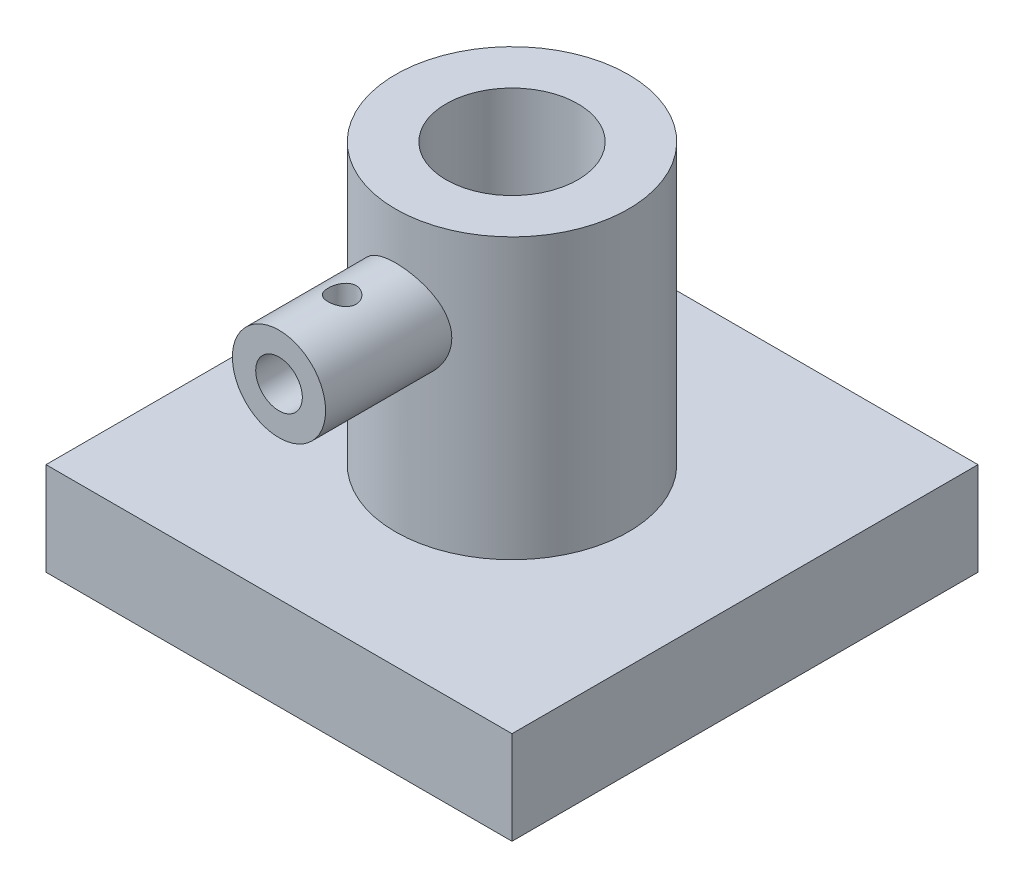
ISO-10303-21;
HEADER;
FILE_DESCRIPTION(('STEP AP214'),'2;1');
FILE_NAME('part.step','',(''),(''),'','','');
FILE_SCHEMA(('AUTOMOTIVE_DESIGN { 1 0 10303 214 1 1 1 1 }'));
ENDSEC;
DATA;
#1=APPLICATION_CONTEXT('core data for automotive mechanical design processes');
#2=APPLICATION_PROTOCOL_DEFINITION('international standard','automotive_design',2000,#1);
#3=PRODUCT_CONTEXT('',#1,'mechanical');
#4=PRODUCT('Part','Part','',(#3));
#5=PRODUCT_RELATED_PRODUCT_CATEGORY('part','',(#4));
#6=PRODUCT_DEFINITION_FORMATION('','',#4);
#7=PRODUCT_DEFINITION_CONTEXT('part definition',#1,'design');
#8=PRODUCT_DEFINITION('design','',#6,#7);
#9=PRODUCT_DEFINITION_SHAPE('','',#8);
#10=(LENGTH_UNIT() NAMED_UNIT(*) SI_UNIT(.MILLI.,.METRE.));
#11=(NAMED_UNIT(*) PLANE_ANGLE_UNIT() SI_UNIT($,.RADIAN.));
#12=(NAMED_UNIT(*) SI_UNIT($,.STERADIAN.) SOLID_ANGLE_UNIT());
#13=UNCERTAINTY_MEASURE_WITH_UNIT(LENGTH_MEASURE(1.E-05),#10,'distance_accuracy_value','');
#14=(GEOMETRIC_REPRESENTATION_CONTEXT(3) GLOBAL_UNCERTAINTY_ASSIGNED_CONTEXT((#13)) GLOBAL_UNIT_ASSIGNED_CONTEXT((#10,
#11,#12)) REPRESENTATION_CONTEXT('',''));
#15=CARTESIAN_POINT('',(0.,0.,0.));
#16=DIRECTION('',(0.,0.,1.));
#17=DIRECTION('',(1.,0.,0.));
#18=AXIS2_PLACEMENT_3D('',#15,#16,#17);
#19=CARTESIAN_POINT('',(-55.1414213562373,0.,0.));
#20=DIRECTION('',(0.,1.,0.));
#21=DIRECTION('',(0.,0.,1.));
#22=AXIS2_PLACEMENT_3D('',#19,#20,#21);
#23=PLANE('',#22);
#24=DIRECTION('',(1.,0.,0.));
#25=VECTOR('',#24,1.);
#26=CARTESIAN_POINT('',(-55.1414213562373,0.,25.));
#27=LINE('',#26,#25);
#28=CARTESIAN_POINT('',(-25.,0.,25.));
#29=VERTEX_POINT('',#28);
#30=CARTESIAN_POINT('',(25.,0.,25.));
#31=VERTEX_POINT('',#30);
#32=EDGE_CURVE('E92',#29,#31,#27,.T.);
#33=ORIENTED_EDGE('',*,*,#32,.T.);
#34=DIRECTION('',(0.,0.,1.));
#35=VECTOR('',#34,1.);
#36=CARTESIAN_POINT('',(25.,0.,0.));
#37=LINE('',#36,#35);
#38=CARTESIAN_POINT('',(25.,0.,-25.));
#39=VERTEX_POINT('',#38);
#40=EDGE_CURVE('E101',#39,#31,#37,.T.);
#41=ORIENTED_EDGE('',*,*,#40,.F.);
#42=DIRECTION('',(1.,0.,0.));
#43=VECTOR('',#42,1.);
#44=CARTESIAN_POINT('',(-55.1414213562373,0.,-25.));
#45=LINE('',#44,#43);
#46=CARTESIAN_POINT('',(-25.,0.,-25.));
#47=VERTEX_POINT('',#46);
#48=EDGE_CURVE('E106',#47,#39,#45,.T.);
#49=ORIENTED_EDGE('',*,*,#48,.F.);
#50=DIRECTION('',(0.,0.,1.));
#51=VECTOR('',#50,1.);
#52=CARTESIAN_POINT('',(-25.,0.,0.));
#53=LINE('',#52,#51);
#54=EDGE_CURVE('E109',#47,#29,#53,.T.);
#55=ORIENTED_EDGE('',*,*,#54,.T.);
#56=EDGE_LOOP('',(#33,#41,#49,#55));
#57=FACE_BOUND('',#56,.T.);
#58=CARTESIAN_POINT('',(0.,0.,0.));
#59=DIRECTION('',(0.,1.,0.));
#60=DIRECTION('',(0.,0.,1.));
#61=AXIS2_PLACEMENT_3D('',#58,#59,#60);
#62=CIRCLE('',#61,12.5);
#63=CARTESIAN_POINT('',(0.,0.,12.5));
#64=VERTEX_POINT('',#63);
#65=EDGE_CURVE('E113',#64,#64,#62,.T.);
#66=ORIENTED_EDGE('',*,*,#65,.F.);
#67=EDGE_LOOP('',(#66));
#68=FACE_BOUND('',#67,.T.);
#69=ADVANCED_FACE('F45',(#57,#68),#23,.T.);
#70=CARTESIAN_POINT('',(-55.1414213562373,-10.,25.));
#71=DIRECTION('',(0.,0.,1.));
#72=DIRECTION('',(1.,0.,0.));
#73=AXIS2_PLACEMENT_3D('',#70,#71,#72);
#74=PLANE('',#73);
#75=ORIENTED_EDGE('',*,*,#32,.F.);
#76=DIRECTION('',(0.,1.,0.));
#77=VECTOR('',#76,1.);
#78=CARTESIAN_POINT('',(-25.,-10.,25.));
#79=LINE('',#78,#77);
#80=CARTESIAN_POINT('',(-25.,-10.,25.));
#81=VERTEX_POINT('',#80);
#82=EDGE_CURVE('E13',#81,#29,#79,.T.);
#83=ORIENTED_EDGE('',*,*,#82,.F.);
#84=DIRECTION('',(1.,0.,0.));
#85=VECTOR('',#84,1.);
#86=CARTESIAN_POINT('',(-55.1414213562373,-10.,25.));
#87=LINE('',#86,#85);
#88=CARTESIAN_POINT('',(25.,-10.,25.));
#89=VERTEX_POINT('',#88);
#90=EDGE_CURVE('E94',#81,#89,#87,.T.);
#91=ORIENTED_EDGE('',*,*,#90,.T.);
#92=DIRECTION('',(0.,1.,0.));
#93=VECTOR('',#92,1.);
#94=CARTESIAN_POINT('',(25.,-10.,25.));
#95=LINE('',#94,#93);
#96=EDGE_CURVE('E89',#89,#31,#95,.T.);
#97=ORIENTED_EDGE('',*,*,#96,.T.);
#98=EDGE_LOOP('',(#75,#83,#91,#97));
#99=FACE_BOUND('',#98,.T.);
#100=ADVANCED_FACE('F47',(#99),#74,.T.);
#101=CARTESIAN_POINT('',(-25.,-10.,0.));
#102=DIRECTION('',(-1.,0.,0.));
#103=DIRECTION('',(0.,0.,1.));
#104=AXIS2_PLACEMENT_3D('',#101,#102,#103);
#105=PLANE('',#104);
#106=ORIENTED_EDGE('',*,*,#54,.F.);
#107=DIRECTION('',(0.,1.,0.));
#108=VECTOR('',#107,1.);
#109=CARTESIAN_POINT('',(-25.,-10.,-25.));
#110=LINE('',#109,#108);
#111=CARTESIAN_POINT('',(-25.,-10.,-25.));
#112=VERTEX_POINT('',#111);
#113=EDGE_CURVE('E58',#112,#47,#110,.T.);
#114=ORIENTED_EDGE('',*,*,#113,.F.);
#115=DIRECTION('',(0.,0.,1.));
#116=VECTOR('',#115,1.);
#117=CARTESIAN_POINT('',(-25.,-10.,0.));
#118=LINE('',#117,#116);
#119=EDGE_CURVE('E98',#112,#81,#118,.T.);
#120=ORIENTED_EDGE('',*,*,#119,.T.);
#121=ORIENTED_EDGE('',*,*,#82,.T.);
#122=EDGE_LOOP('',(#106,#114,#120,#121));
#123=FACE_BOUND('',#122,.T.);
#124=ADVANCED_FACE('F129',(#123),#105,.T.);
#125=CARTESIAN_POINT('',(-55.1414213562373,-10.,-25.));
#126=DIRECTION('',(0.,0.,1.));
#127=DIRECTION('',(1.,0.,0.));
#128=AXIS2_PLACEMENT_3D('',#125,#126,#127);
#129=PLANE('',#128);
#130=ORIENTED_EDGE('',*,*,#48,.T.);
#131=DIRECTION('',(0.,1.,0.));
#132=VECTOR('',#131,1.);
#133=CARTESIAN_POINT('',(25.,-10.,-25.));
#134=LINE('',#133,#132);
#135=CARTESIAN_POINT('',(25.,-10.,-25.));
#136=VERTEX_POINT('',#135);
#137=EDGE_CURVE('E97',#136,#39,#134,.T.);
#138=ORIENTED_EDGE('',*,*,#137,.F.);
#139=DIRECTION('',(1.,0.,0.));
#140=VECTOR('',#139,1.);
#141=CARTESIAN_POINT('',(-55.1414213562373,-10.,-25.));
#142=LINE('',#141,#140);
#143=EDGE_CURVE('E122',#112,#136,#142,.T.);
#144=ORIENTED_EDGE('',*,*,#143,.F.);
#145=ORIENTED_EDGE('',*,*,#113,.T.);
#146=EDGE_LOOP('',(#130,#138,#144,#145));
#147=FACE_BOUND('',#146,.T.);
#148=ADVANCED_FACE('F127',(#147),#129,.F.);
#149=CARTESIAN_POINT('',(25.,-10.,0.));
#150=DIRECTION('',(-1.,0.,0.));
#151=DIRECTION('',(0.,0.,1.));
#152=AXIS2_PLACEMENT_3D('',#149,#150,#151);
#153=PLANE('',#152);
#154=ORIENTED_EDGE('',*,*,#40,.T.);
#155=ORIENTED_EDGE('',*,*,#96,.F.);
#156=DIRECTION('',(0.,0.,1.));
#157=VECTOR('',#156,1.);
#158=CARTESIAN_POINT('',(25.,-10.,0.));
#159=LINE('',#158,#157);
#160=EDGE_CURVE('E120',#136,#89,#159,.T.);
#161=ORIENTED_EDGE('',*,*,#160,.F.);
#162=ORIENTED_EDGE('',*,*,#137,.T.);
#163=EDGE_LOOP('',(#154,#155,#161,#162));
#164=FACE_BOUND('',#163,.T.);
#165=ADVANCED_FACE('F102',(#164),#153,.F.);
#166=CARTESIAN_POINT('',(-55.1414213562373,-10.,0.));
#167=DIRECTION('',(0.,1.,0.));
#168=DIRECTION('',(0.,0.,1.));
#169=AXIS2_PLACEMENT_3D('',#166,#167,#168);
#170=PLANE('',#169);
#171=CARTESIAN_POINT('',(0.,-10.,0.));
#172=DIRECTION('',(0.,1.,0.));
#173=DIRECTION('',(0.,0.,1.));
#174=AXIS2_PLACEMENT_3D('',#171,#172,#173);
#175=CIRCLE('',#174,7.07106781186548);
#176=CARTESIAN_POINT('',(0.,-10.,7.07106781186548));
#177=VERTEX_POINT('',#176);
#178=EDGE_CURVE('E197',#177,#177,#175,.T.);
#179=ORIENTED_EDGE('',*,*,#178,.T.);
#180=EDGE_LOOP('',(#179));
#181=FACE_BOUND('',#180,.T.);
#182=ORIENTED_EDGE('',*,*,#90,.F.);
#183=ORIENTED_EDGE('',*,*,#119,.F.);
#184=ORIENTED_EDGE('',*,*,#143,.T.);
#185=ORIENTED_EDGE('',*,*,#160,.T.);
#186=EDGE_LOOP('',(#182,#183,#184,#185));
#187=FACE_BOUND('',#186,.T.);
#188=ADVANCED_FACE('F131',(#181,#187),#170,.F.);
#189=CARTESIAN_POINT('',(0.,30.,0.));
#190=DIRECTION('',(0.,-1.,0.));
#191=DIRECTION('',(0.,0.,-1.));
#192=AXIS2_PLACEMENT_3D('',#189,#190,#191);
#193=CYLINDRICAL_SURFACE('',#192,12.5);
#194=CARTESIAN_POINT('',(0.,25.,12.5));
#195=CARTESIAN_POINT('',(0.134428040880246,24.9999992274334,12.4999993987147));
#196=CARTESIAN_POINT('',(0.268907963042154,24.9945712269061,12.4978254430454));
#197=CARTESIAN_POINT('',(0.536916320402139,24.972908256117,12.4891841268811));
#198=CARTESIAN_POINT('',(0.670444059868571,24.9566660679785,12.482713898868));
#199=CARTESIAN_POINT('',(0.935792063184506,24.9134912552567,12.4656328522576));
#200=CARTESIAN_POINT('',(1.06760803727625,24.8865357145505,12.45501315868));
#201=CARTESIAN_POINT('',(1.32834211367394,24.822193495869,12.4299104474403));
#202=CARTESIAN_POINT('',(1.45725900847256,24.7848025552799,12.4154258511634));
#203=CARTESIAN_POINT('',(1.71081101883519,24.7000976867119,12.3830283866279));
#204=CARTESIAN_POINT('',(1.83546024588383,24.6528210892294,12.3651284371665));
#205=CARTESIAN_POINT('',(2.08021423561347,24.5486729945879,12.3263173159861));
#206=CARTESIAN_POINT('',(2.20031728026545,24.4917979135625,12.3054050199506));
#207=CARTESIAN_POINT('',(2.5525365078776,24.3075069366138,12.2389309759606));
#208=CARTESIAN_POINT('',(2.77691477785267,24.1663067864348,12.1895849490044));
#209=CARTESIAN_POINT('',(3.20878788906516,23.8444050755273,12.0832695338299));
#210=CARTESIAN_POINT('',(3.41514420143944,23.6622677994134,12.0260638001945));
#211=CARTESIAN_POINT('',(3.795448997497,23.2664655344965,11.9115080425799));
#212=CARTESIAN_POINT('',(3.96938162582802,23.0527852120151,11.8541579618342));
#213=CARTESIAN_POINT('',(4.20603567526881,22.7073939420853,11.7714356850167));
#214=CARTESIAN_POINT('',(4.28222203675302,22.585220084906,11.7438622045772));
#215=CARTESIAN_POINT('',(4.42396507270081,22.3343638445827,11.6912035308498));
#216=CARTESIAN_POINT('',(4.4895261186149,22.2056841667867,11.6661173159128));
#217=CARTESIAN_POINT('',(4.60945924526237,21.9426245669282,11.6192528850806));
#218=CARTESIAN_POINT('',(4.66383056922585,21.8082442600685,11.5974748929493));
#219=CARTESIAN_POINT('',(4.76082403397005,21.5347911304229,11.5579971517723));
#220=CARTESIAN_POINT('',(4.8034520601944,21.39572069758,11.5402953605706));
#221=CARTESIAN_POINT('',(4.87487504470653,21.1202338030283,11.5103008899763));
#222=CARTESIAN_POINT('',(4.90420529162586,20.9839786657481,11.4978009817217));
#223=CARTESIAN_POINT('',(4.95140857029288,20.7092063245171,11.4775526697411));
#224=CARTESIAN_POINT('',(4.9692867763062,20.5706901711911,11.4698021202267));
#225=CARTESIAN_POINT('',(4.99338985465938,20.2924867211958,11.4593294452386));
#226=CARTESIAN_POINT('',(4.99961718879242,20.152799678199,11.4566062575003));
#227=CARTESIAN_POINT('',(5.00034850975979,19.8733924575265,11.4562871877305));
#228=CARTESIAN_POINT('',(4.99485304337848,19.7336722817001,11.4586910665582));
#229=CARTESIAN_POINT('',(4.97300139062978,19.4650957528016,11.4681900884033));
#230=CARTESIAN_POINT('',(4.95743098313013,19.3361625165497,11.4749456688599));
#231=CARTESIAN_POINT('',(4.91636669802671,19.0801331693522,11.4925992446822));
#232=CARTESIAN_POINT('',(4.89086955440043,18.9530376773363,11.5034986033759));
#233=CARTESIAN_POINT('',(4.83020381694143,18.7015982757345,11.5291029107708));
#234=CARTESIAN_POINT('',(4.79503755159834,18.5772537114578,11.5438069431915));
#235=CARTESIAN_POINT('',(4.71535272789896,18.332038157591,11.5765839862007));
#236=CARTESIAN_POINT('',(4.67083057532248,18.2111685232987,11.5946582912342));
#237=CARTESIAN_POINT('',(4.52178156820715,17.850100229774,11.6539749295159));
#238=CARTESIAN_POINT('',(4.40296429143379,17.6163670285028,11.6997808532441));
#239=CARTESIAN_POINT('',(4.13125151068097,17.1714203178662,11.7984565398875));
#240=CARTESIAN_POINT('',(3.97834320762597,16.9602153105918,11.851328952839));
#241=CARTESIAN_POINT('',(3.62889137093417,16.5489925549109,11.9631659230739));
#242=CARTESIAN_POINT('',(3.42988845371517,16.3511017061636,12.0222854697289));
#243=CARTESIAN_POINT('',(3.0007412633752,15.9907652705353,12.1365017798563));
#244=CARTESIAN_POINT('',(2.77059080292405,15.8283267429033,12.1915977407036));
#245=CARTESIAN_POINT('',(2.40397180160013,15.6134750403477,12.2673153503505));
#246=CARTESIAN_POINT('',(2.2767950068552,15.5461273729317,12.2916102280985));
#247=CARTESIAN_POINT('',(2.01664956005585,15.4224644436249,12.3369572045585));
#248=CARTESIAN_POINT('',(1.88368330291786,15.3661446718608,12.3580106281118));
#249=CARTESIAN_POINT('',(1.61291597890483,15.2650884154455,12.3962575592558));
#250=CARTESIAN_POINT('',(1.47511586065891,15.2203496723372,12.4134518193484));
#251=CARTESIAN_POINT('',(1.19570710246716,15.1429130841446,12.4434728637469));
#252=CARTESIAN_POINT('',(1.05409872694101,15.1102144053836,12.4562999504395));
#253=CARTESIAN_POINT('',(0.776729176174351,15.0588068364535,12.4765727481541));
#254=CARTESIAN_POINT('',(0.641120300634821,15.0393823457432,12.4842928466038));
#255=CARTESIAN_POINT('',(0.368536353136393,15.0117185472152,12.4953107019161));
#256=CARTESIAN_POINT('',(0.231560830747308,15.0034830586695,12.4986069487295));
#257=CARTESIAN_POINT('',(-0.0425534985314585,14.9983032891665,12.5006785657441));
#258=CARTESIAN_POINT('',(-0.179692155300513,15.0013521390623,12.4994566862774));
#259=CARTESIAN_POINT('',(-0.453193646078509,15.0186951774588,12.4925311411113));
#260=CARTESIAN_POINT('',(-0.589556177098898,15.032993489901,12.4868258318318));
#261=CARTESIAN_POINT('',(-0.854248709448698,15.0717821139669,12.4714486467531));
#262=CARTESIAN_POINT('',(-0.982662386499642,15.095780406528,12.4619685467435));
#263=CARTESIAN_POINT('',(-1.236951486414,15.1536650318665,12.4393027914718));
#264=CARTESIAN_POINT('',(-1.36282600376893,15.1875548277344,12.4261158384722));
#265=CARTESIAN_POINT('',(-1.61115102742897,15.2649082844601,12.396363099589));
#266=CARTESIAN_POINT('',(-1.73360251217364,15.3083691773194,12.3797982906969));
#267=CARTESIAN_POINT('',(-1.97439656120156,15.4045030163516,12.3436873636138));
#268=CARTESIAN_POINT('',(-2.0927375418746,15.4571794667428,12.324140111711));
#269=CARTESIAN_POINT('',(-2.44755555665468,15.6319072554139,12.2604306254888));
#270=CARTESIAN_POINT('',(-2.67640599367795,15.7683460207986,12.2121249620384));
#271=CARTESIAN_POINT('',(-3.10864805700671,16.0748684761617,12.1093295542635));
#272=CARTESIAN_POINT('',(-3.31202942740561,16.2449656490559,12.0548373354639));
#273=CARTESIAN_POINT('',(-3.70179180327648,16.6271584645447,11.941130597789));
#274=CARTESIAN_POINT('',(-3.88616393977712,16.8412854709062,11.8818418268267));
#275=CARTESIAN_POINT('',(-4.21689889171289,17.2986485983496,11.7685360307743));
#276=CARTESIAN_POINT('',(-4.3632554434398,17.5418895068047,11.7145198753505));
#277=CARTESIAN_POINT('',(-4.55142555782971,17.9251186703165,11.6421255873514));
#278=CARTESIAN_POINT('',(-4.60914530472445,18.0566797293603,11.6193337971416));
#279=CARTESIAN_POINT('',(-4.71320516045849,18.3247871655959,11.5775147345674));
#280=CARTESIAN_POINT('',(-4.75955021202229,18.4613313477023,11.5584858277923));
#281=CARTESIAN_POINT('',(-4.84036067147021,18.7383631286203,11.5248785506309));
#282=CARTESIAN_POINT('',(-4.87483074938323,18.8788491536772,11.5102984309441));
#283=CARTESIAN_POINT('',(-4.93151664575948,19.1626946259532,11.4861263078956));
#284=CARTESIAN_POINT('',(-4.95373349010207,19.3060538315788,11.4765338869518));
#285=CARTESIAN_POINT('',(-4.98448195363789,19.5839989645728,11.463210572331));
#286=CARTESIAN_POINT('',(-4.9938856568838,19.7184712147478,11.4591065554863));
#287=CARTESIAN_POINT('',(-5.00180093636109,19.9878460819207,11.4556539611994));
#288=CARTESIAN_POINT('',(-5.00030885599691,20.1227488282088,11.4563069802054));
#289=CARTESIAN_POINT('',(-4.9864434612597,20.3918171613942,11.4623486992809));
#290=CARTESIAN_POINT('',(-4.97407559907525,20.5259830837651,11.4677350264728));
#291=CARTESIAN_POINT('',(-4.93860056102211,20.7926720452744,11.4830569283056));
#292=CARTESIAN_POINT('',(-4.91548933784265,20.9251944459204,11.4929942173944));
#293=CARTESIAN_POINT('',(-4.85990688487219,21.182329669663,11.5166044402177));
#294=CARTESIAN_POINT('',(-4.82784722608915,21.3070467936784,11.5301119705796));
#295=CARTESIAN_POINT('',(-4.7543555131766,21.553266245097,11.5606089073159));
#296=CARTESIAN_POINT('',(-4.71292020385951,21.6747674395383,11.5775995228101));
#297=CARTESIAN_POINT('',(-4.57505004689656,22.0333144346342,11.6330901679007));
#298=CARTESIAN_POINT('',(-4.46501084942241,22.2645872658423,11.6761269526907));
#299=CARTESIAN_POINT('',(-4.20467910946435,22.7190564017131,11.7724663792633));
#300=CARTESIAN_POINT('',(-4.05244254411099,22.9410320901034,11.8262157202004));
#301=CARTESIAN_POINT('',(-3.71470108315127,23.3574978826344,11.9366014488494));
#302=CARTESIAN_POINT('',(-3.52918616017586,23.5519796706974,11.9932387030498));
#303=CARTESIAN_POINT('',(-3.22271513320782,23.8255134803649,12.0779292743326));
#304=CARTESIAN_POINT('',(-3.11206947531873,23.9160564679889,12.1069791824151));
#305=CARTESIAN_POINT('',(-2.88318647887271,24.0874993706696,12.1635153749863));
#306=CARTESIAN_POINT('',(-2.76495189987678,24.1684027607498,12.1910022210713));
#307=CARTESIAN_POINT('',(-2.52148785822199,24.3200337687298,12.2436771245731));
#308=CARTESIAN_POINT('',(-2.3962519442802,24.3907517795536,12.268863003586));
#309=CARTESIAN_POINT('',(-2.13974317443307,24.5213045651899,12.3161883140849));
#310=CARTESIAN_POINT('',(-2.00847311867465,24.5811443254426,12.338329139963));
#311=CARTESIAN_POINT('',(-1.7431850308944,24.6884332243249,12.378569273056));
#312=CARTESIAN_POINT('',(-1.60925996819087,24.736087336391,12.3967345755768));
#313=CARTESIAN_POINT('',(-1.33744351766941,24.819902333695,12.4289968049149));
#314=CARTESIAN_POINT('',(-1.19955402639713,24.8560686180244,12.4430956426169));
#315=CARTESIAN_POINT('',(-0.921178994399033,24.9164690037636,12.4667917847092));
#316=CARTESIAN_POINT('',(-0.780700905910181,24.9407330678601,12.4764003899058));
#317=CARTESIAN_POINT('',(-0.498015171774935,24.977174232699,12.4908758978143));
#318=CARTESIAN_POINT('',(-0.355808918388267,24.9893604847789,12.4957463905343));
#319=CARTESIAN_POINT('',(-0.177825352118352,24.9969636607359,12.4987857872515));
#320=CARTESIAN_POINT('',(-0.142272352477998,24.9981020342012,12.4992409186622));
#321=CARTESIAN_POINT('',(-0.071147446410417,24.9996203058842,12.4998481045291));
#322=CARTESIAN_POINT('',(-0.0355755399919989,25.0000002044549,12.5000001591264));
#323=CARTESIAN_POINT('',(0.,25.,12.5));
#324=B_SPLINE_CURVE_WITH_KNOTS('',3,(#194,#195,#196,#197,#198,#199,#200,#201,#202,#203,#204,
#205,#206,#207,#208,#209,#210,#211,#212,#213,#214,#215,#216,#217,#218,#219,#220,#221,#222,#223,
#224,#225,#226,#227,#228,#229,#230,#231,#232,#233,#234,#235,#236,#237,#238,#239,#240,#241,#242,
#243,#244,#245,#246,#247,#248,#249,#250,#251,#252,#253,#254,#255,#256,#257,#258,#259,#260,#261,
#262,#263,#264,#265,#266,#267,#268,#269,#270,#271,#272,#273,#274,#275,#276,#277,#278,#279,#280,
#281,#282,#283,#284,#285,#286,#287,#288,#289,#290,#291,#292,#293,#294,#295,#296,#297,#298,#299,
#300,#301,#302,#303,#304,#305,#306,#307,#308,#309,#310,#311,#312,#313,#314,#315,#316,#317,#318,
#319,#320,#321,#322,#323),.UNSPECIFIED.,.T.,.F.,(4,2,2,2,2,2,2,2,2,2,2,2,2,2,2,2,2,2,2,2,2,2,2,
2,2,2,2,2,2,2,2,2,2,2,2,2,2,2,2,2,2,2,2,2,2,2,2,2,2,2,2,2,2,2,2,2,2,2,2,2,2,2,2,2,4),(0.,
0.403247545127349,0.806764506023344,1.21114928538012,1.61569948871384,2.01874874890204,
2.42194883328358,3.22723902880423,4.06710473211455,4.90738006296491,5.34671991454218,
5.78587855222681,6.22506688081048,6.66403469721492,7.08328748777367,7.50235071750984,
7.92132539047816,8.34028052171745,8.7299592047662,9.11976620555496,9.50947941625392,
9.89934261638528,10.6941760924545,11.4893084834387,12.345906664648,13.2026752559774,
13.6400384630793,14.0772224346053,14.5143210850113,14.9513894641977,15.3624968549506,
15.7737445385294,16.1847419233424,16.5958900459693,16.9883780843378,17.3810037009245,
17.7735159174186,18.1661777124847,18.9747143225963,19.783575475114,20.6458383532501,
21.5082432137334,21.944151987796,22.379871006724,22.815418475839,23.2509294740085,
23.6550039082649,24.0592139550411,24.4632214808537,24.8673813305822,25.2553678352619,
25.6434892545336,26.4191721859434,27.2392679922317,28.0596113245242,28.4968494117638,
28.9339293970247,29.3714189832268,29.8087075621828,30.2380680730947,30.667226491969,
31.0952989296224,31.5230467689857,31.6297637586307,31.7364806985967),.UNSPECIFIED.);
#325=CARTESIAN_POINT('',(0.,25.,12.5));
#326=VERTEX_POINT('',#325);
#327=EDGE_CURVE('E49',#326,#326,#324,.T.);
#328=ORIENTED_EDGE('',*,*,#327,.T.);
#329=EDGE_LOOP('',(#328));
#330=FACE_BOUND('',#329,.T.);
#331=CARTESIAN_POINT('',(0.,30.,0.));
#332=DIRECTION('',(0.,1.,0.));
#333=DIRECTION('',(0.,0.,1.));
#334=AXIS2_PLACEMENT_3D('',#331,#332,#333);
#335=CIRCLE('',#334,12.5);
#336=CARTESIAN_POINT('',(0.,30.,12.5));
#337=VERTEX_POINT('',#336);
#338=EDGE_CURVE('E110',#337,#337,#335,.T.);
#339=ORIENTED_EDGE('',*,*,#338,.F.);
#340=EDGE_LOOP('',(#339));
#341=FACE_BOUND('',#340,.T.);
#342=ORIENTED_EDGE('',*,*,#65,.T.);
#343=EDGE_LOOP('',(#342));
#344=FACE_BOUND('',#343,.T.);
#345=ADVANCED_FACE('F133',(#330,#341,#344),#193,.T.);
#346=CARTESIAN_POINT('',(0.,30.,0.));
#347=DIRECTION('',(0.,1.,0.));
#348=DIRECTION('',(0.,0.,1.));
#349=AXIS2_PLACEMENT_3D('',#346,#347,#348);
#350=PLANE('',#349);
#351=CARTESIAN_POINT('',(0.,30.,0.));
#352=DIRECTION('',(0.,1.,0.));
#353=DIRECTION('',(0.,0.,1.));
#354=AXIS2_PLACEMENT_3D('',#351,#352,#353);
#355=CIRCLE('',#354,7.07106781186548);
#356=CARTESIAN_POINT('',(0.,30.,7.07106781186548));
#357=VERTEX_POINT('',#356);
#358=EDGE_CURVE('E169',#357,#357,#355,.T.);
#359=ORIENTED_EDGE('',*,*,#358,.F.);
#360=EDGE_LOOP('',(#359));
#361=FACE_BOUND('',#360,.T.);
#362=ORIENTED_EDGE('',*,*,#338,.T.);
#363=EDGE_LOOP('',(#362));
#364=FACE_BOUND('',#363,.T.);
#365=ADVANCED_FACE('F140',(#361,#364),#350,.T.);
#366=CARTESIAN_POINT('',(0.,20.,0.));
#367=DIRECTION('',(0.,0.,-1.));
#368=DIRECTION('',(0.,1.,0.));
#369=AXIS2_PLACEMENT_3D('',#366,#367,#368);
#370=CYLINDRICAL_SURFACE('',#369,5.);
#371=CARTESIAN_POINT('',(0.,25.,19.7282196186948));
#372=CARTESIAN_POINT('',(0.0822886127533,24.9999992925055,19.7282186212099));
#373=CARTESIAN_POINT('',(0.16458731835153,24.9979491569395,19.7214257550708));
#374=CARTESIAN_POINT('',(0.326788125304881,24.9899710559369,19.6944982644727));
#375=CARTESIAN_POINT('',(0.40668950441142,24.9840419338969,19.6743596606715));
#376=CARTESIAN_POINT('',(0.561732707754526,24.9689555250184,19.6214736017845));
#377=CARTESIAN_POINT('',(0.636881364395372,24.9598030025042,19.5887447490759));
#378=CARTESIAN_POINT('',(0.78062418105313,24.9392210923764,19.511683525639));
#379=CARTESIAN_POINT('',(0.849217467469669,24.9277914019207,19.4673496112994));
#380=CARTESIAN_POINT('',(0.979871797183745,24.9035073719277,19.3669956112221));
#381=CARTESIAN_POINT('',(1.04171807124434,24.8906238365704,19.3107029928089));
#382=CARTESIAN_POINT('',(1.15524920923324,24.8650583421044,19.1886103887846));
#383=CARTESIAN_POINT('',(1.20693236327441,24.852376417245,19.1228088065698));
#384=CARTESIAN_POINT('',(1.29980037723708,24.8283411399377,18.9817488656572));
#385=CARTESIAN_POINT('',(1.34072309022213,24.8170240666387,18.9063111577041));
#386=CARTESIAN_POINT('',(1.4092139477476,24.7974362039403,18.7492303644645));
#387=CARTESIAN_POINT('',(1.43678529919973,24.7891646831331,18.6675887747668));
#388=CARTESIAN_POINT('',(1.47701633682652,24.7769087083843,18.5028293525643));
#389=CARTESIAN_POINT('',(1.49007196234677,24.7728106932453,18.4198168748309));
#390=CARTESIAN_POINT('',(1.50213730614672,24.7690278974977,18.252686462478));
#391=CARTESIAN_POINT('',(1.50115042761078,24.7693420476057,18.1685688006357));
#392=CARTESIAN_POINT('',(1.48546977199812,24.7742474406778,18.0048357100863));
#393=CARTESIAN_POINT('',(1.47127205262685,24.7786838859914,17.9251673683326));
#394=CARTESIAN_POINT('',(1.43037420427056,24.7910835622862,17.7693998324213));
#395=CARTESIAN_POINT('',(1.40367284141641,24.7990471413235,17.6933009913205));
#396=CARTESIAN_POINT('',(1.33816026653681,24.8177273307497,17.5456192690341));
#397=CARTESIAN_POINT('',(1.29918816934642,24.8284801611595,17.4741125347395));
#398=CARTESIAN_POINT('',(1.21035222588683,24.8515098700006,17.3384875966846));
#399=CARTESIAN_POINT('',(1.16048574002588,24.8637871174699,17.274371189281));
#400=CARTESIAN_POINT('',(1.04881290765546,24.8891101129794,17.1525334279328));
#401=CARTESIAN_POINT('',(0.986594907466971,24.902166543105,17.0951909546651));
#402=CARTESIAN_POINT('',(0.853263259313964,24.9271224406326,16.9916656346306));
#403=CARTESIAN_POINT('',(0.782149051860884,24.9390218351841,16.9454834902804));
#404=CARTESIAN_POINT('',(0.6323550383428,24.9604316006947,16.8653596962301));
#405=CARTESIAN_POINT('',(0.553627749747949,24.9699254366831,16.8315021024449));
#406=CARTESIAN_POINT('',(0.391245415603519,24.9853352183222,16.7776200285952));
#407=CARTESIAN_POINT('',(0.30759175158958,24.99125216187,16.7575916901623));
#408=CARTESIAN_POINT('',(0.14095224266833,24.9986836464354,16.7325674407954));
#409=CARTESIAN_POINT('',(0.0580500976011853,25.0003485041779,16.7270580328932));
#410=CARTESIAN_POINT('',(-0.107499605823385,24.9995292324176,16.7297887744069));
#411=CARTESIAN_POINT('',(-0.190147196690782,24.9970456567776,16.7380270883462));
#412=CARTESIAN_POINT('',(-0.350903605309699,24.9883069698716,16.7676042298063));
#413=CARTESIAN_POINT('',(-0.429072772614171,24.9821382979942,16.7886430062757));
#414=CARTESIAN_POINT('',(-0.580754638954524,24.9667434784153,16.842862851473));
#415=CARTESIAN_POINT('',(-0.654266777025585,24.9575169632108,16.8760453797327));
#416=CARTESIAN_POINT('',(-0.796437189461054,24.9366965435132,16.9544727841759));
#417=CARTESIAN_POINT('',(-0.864943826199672,24.9250528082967,16.9999789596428));
#418=CARTESIAN_POINT('',(-0.993523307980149,24.9007346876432,17.1014443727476));
#419=CARTESIAN_POINT('',(-1.05359403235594,24.8880600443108,17.1574062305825));
#420=CARTESIAN_POINT('',(-1.16585744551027,24.8625317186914,17.2806069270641));
#421=CARTESIAN_POINT('',(-1.21768481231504,24.8496882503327,17.3481814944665));
#422=CARTESIAN_POINT('',(-1.30928995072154,24.8257651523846,17.4913475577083));
#423=CARTESIAN_POINT('',(-1.34906803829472,24.8146854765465,17.566938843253));
#424=CARTESIAN_POINT('',(-1.41517347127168,24.7956718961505,17.7237521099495));
#425=CARTESIAN_POINT('',(-1.4415634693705,24.7877233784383,17.8049458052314));
#426=CARTESIAN_POINT('',(-1.48021730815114,24.7759159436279,17.9709075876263));
#427=CARTESIAN_POINT('',(-1.49248598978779,24.772055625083,18.0556744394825));
#428=CARTESIAN_POINT('',(-1.50221984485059,24.7689997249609,18.222581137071));
#429=CARTESIAN_POINT('',(-1.5002805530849,24.7696164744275,18.3046832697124));
#430=CARTESIAN_POINT('',(-1.48307505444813,24.7749940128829,18.4673337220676));
#431=CARTESIAN_POINT('',(-1.46780938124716,24.7797546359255,18.5478821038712));
#432=CARTESIAN_POINT('',(-1.42476888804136,24.7927576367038,18.7041650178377));
#433=CARTESIAN_POINT('',(-1.39715175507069,24.8009560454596,18.7799469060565));
#434=CARTESIAN_POINT('',(-1.33031507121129,24.8199027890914,18.9258620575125));
#435=CARTESIAN_POINT('',(-1.29109329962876,24.8306516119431,18.9959942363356));
#436=CARTESIAN_POINT('',(-1.20048763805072,24.8539767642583,19.1313827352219));
#437=CARTESIAN_POINT('',(-1.14871276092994,24.866605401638,19.1963683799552));
#438=CARTESIAN_POINT('',(-1.03517434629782,24.8920132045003,19.3169221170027));
#439=CARTESIAN_POINT('',(-0.973408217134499,24.904792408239,19.3724877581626));
#440=CARTESIAN_POINT('',(-0.839465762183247,24.9295093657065,19.4742430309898));
#441=CARTESIAN_POINT('',(-0.767037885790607,24.9414115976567,19.5201110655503));
#442=CARTESIAN_POINT('',(-0.615141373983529,24.9626068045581,19.5989547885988));
#443=CARTESIAN_POINT('',(-0.535676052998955,24.9719009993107,19.6319365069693));
#444=CARTESIAN_POINT('',(-0.380757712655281,24.986021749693,19.6811148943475));
#445=CARTESIAN_POINT('',(-0.305786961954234,24.9912202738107,19.698731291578));
#446=CARTESIAN_POINT('',(-0.15388019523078,24.9982094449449,19.7222831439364));
#447=CARTESIAN_POINT('',(-0.0769445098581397,25.0000006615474,19.7282205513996));
#448=CARTESIAN_POINT('',(0.,25.,19.7282196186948));
#449=B_SPLINE_CURVE_WITH_KNOTS('',3,(#371,#372,#373,#374,#375,#376,#377,#378,#379,#380,#381,
#382,#383,#384,#385,#386,#387,#388,#389,#390,#391,#392,#393,#394,#395,#396,#397,#398,#399,#400,
#401,#402,#403,#404,#405,#406,#407,#408,#409,#410,#411,#412,#413,#414,#415,#416,#417,#418,#419,
#420,#421,#422,#423,#424,#425,#426,#427,#428,#429,#430,#431,#432,#433,#434,#435,#436,#437,#438,
#439,#440,#441,#442,#443,#444,#445,#446,#447,#448),.UNSPECIFIED.,.T.,.F.,(4,2,2,2,2,2,2,2,2,2,2,
2,2,2,2,2,2,2,2,2,2,2,2,2,2,2,2,2,2,2,2,2,2,2,2,2,2,2,4),(0.,0.24658320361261,0.493239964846,
0.739533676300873,0.985860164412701,1.23855602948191,1.49129437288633,1.74971481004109,
2.00807314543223,2.25919689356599,2.5102597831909,2.75226016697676,2.99428443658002,
3.2396242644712,3.48502360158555,3.74067104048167,3.99633456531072,4.25371046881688,
4.51101453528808,4.75908809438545,5.00712853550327,5.24956746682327,5.49203554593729,
5.74011305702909,5.98825282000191,6.24540400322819,6.50254844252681,6.75847814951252,
7.01432009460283,7.25950155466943,7.504673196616,7.74680040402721,7.98897397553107,
8.23996925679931,8.49102974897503,8.74942996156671,9.00770911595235,9.2383169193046,
9.46888616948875),.UNSPECIFIED.);
#450=CARTESIAN_POINT('',(0.,25.,19.7282196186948));
#451=VERTEX_POINT('',#450);
#452=EDGE_CURVE('E162',#451,#451,#449,.T.);
#453=ORIENTED_EDGE('',*,*,#452,.F.);
#454=EDGE_LOOP('',(#453));
#455=FACE_BOUND('',#454,.T.);
#456=CARTESIAN_POINT('',(0.,20.,25.));
#457=DIRECTION('',(0.,0.,-1.));
#458=DIRECTION('',(0.,1.,0.));
#459=AXIS2_PLACEMENT_3D('',#456,#457,#458);
#460=CIRCLE('',#459,5.);
#461=CARTESIAN_POINT('',(0.,25.,25.));
#462=VERTEX_POINT('',#461);
#463=EDGE_CURVE('E206',#462,#462,#460,.T.);
#464=ORIENTED_EDGE('',*,*,#463,.T.);
#465=EDGE_LOOP('',(#464));
#466=FACE_BOUND('',#465,.T.);
#467=ORIENTED_EDGE('',*,*,#327,.F.);
#468=EDGE_LOOP('',(#467));
#469=FACE_BOUND('',#468,.T.);
#470=ADVANCED_FACE('F152',(#455,#466,#469),#370,.T.);
#471=CARTESIAN_POINT('',(0.,20.,25.));
#472=DIRECTION('',(0.,0.,1.));
#473=DIRECTION('',(0.,-1.,0.));
#474=AXIS2_PLACEMENT_3D('',#471,#472,#473);
#475=PLANE('',#474);
#476=CARTESIAN_POINT('',(0.,20.,25.));
#477=DIRECTION('',(0.,0.,-1.));
#478=DIRECTION('',(-1.,0.,0.));
#479=AXIS2_PLACEMENT_3D('',#476,#477,#478);
#480=CIRCLE('',#479,2.5);
#481=CARTESIAN_POINT('',(-2.5,20.,25.));
#482=VERTEX_POINT('',#481);
#483=EDGE_CURVE('E203',#482,#482,#480,.T.);
#484=ORIENTED_EDGE('',*,*,#483,.T.);
#485=EDGE_LOOP('',(#484));
#486=FACE_BOUND('',#485,.T.);
#487=ORIENTED_EDGE('',*,*,#463,.F.);
#488=EDGE_LOOP('',(#487));
#489=FACE_BOUND('',#488,.T.);
#490=ADVANCED_FACE('F157',(#486,#489),#475,.T.);
#491=CARTESIAN_POINT('',(0.,20.,5.));
#492=DIRECTION('',(0.,0.,-1.));
#493=DIRECTION('',(-1.,0.,0.));
#494=AXIS2_PLACEMENT_3D('',#491,#492,#493);
#495=CYLINDRICAL_SURFACE('',#494,2.5);
#496=CARTESIAN_POINT('',(0.,22.5,19.7282196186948));
#497=CARTESIAN_POINT('',(-0.0767298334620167,22.4999962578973,19.7282155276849));
#498=CARTESIAN_POINT('',(-0.153582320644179,22.4964290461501,19.7222909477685));
#499=CARTESIAN_POINT('',(-0.304975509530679,22.4824990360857,19.6988952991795));
#500=CARTESIAN_POINT('',(-0.379510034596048,22.4721194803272,19.6813957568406));
#501=CARTESIAN_POINT('',(-0.523751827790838,22.4456155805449,19.6358332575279));
#502=CARTESIAN_POINT('',(-0.593481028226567,22.4295197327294,19.6078226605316));
#503=CARTESIAN_POINT('',(-0.72703031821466,22.3929536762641,19.5423592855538));
#504=CARTESIAN_POINT('',(-0.790851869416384,22.3724845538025,19.5049088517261));
#505=CARTESIAN_POINT('',(-0.916299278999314,22.3270536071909,19.4184447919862));
#506=CARTESIAN_POINT('',(-0.977384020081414,22.3018679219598,19.3687659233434));
#507=CARTESIAN_POINT('',(-1.09088270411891,22.2503043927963,19.2607524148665));
#508=CARTESIAN_POINT('',(-1.14328534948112,22.2239250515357,19.2024066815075));
#509=CARTESIAN_POINT('',(-1.24444996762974,22.1691106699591,19.0702961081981));
#510=CARTESIAN_POINT('',(-1.29197766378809,22.1408201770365,18.9955178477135));
#511=CARTESIAN_POINT('',(-1.37361437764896,22.0893830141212,18.8373730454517));
#512=CARTESIAN_POINT('',(-1.4077451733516,22.0662280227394,18.7540207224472));
#513=CARTESIAN_POINT('',(-1.45440601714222,22.0335462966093,18.6016231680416));
#514=CARTESIAN_POINT('',(-1.47016197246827,22.0220788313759,18.5339836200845));
#515=CARTESIAN_POINT('',(-1.49216172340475,22.005903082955,18.3964159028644));
#516=CARTESIAN_POINT('',(-1.49841734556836,22.0011863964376,18.3264906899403));
#517=CARTESIAN_POINT('',(-1.50105508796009,21.9992092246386,18.1862081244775));
#518=CARTESIAN_POINT('',(-1.49741783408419,22.0019633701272,18.1158501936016));
#519=CARTESIAN_POINT('',(-1.48046060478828,22.0145326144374,17.9769408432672));
#520=CARTESIAN_POINT('',(-1.46713334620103,22.0243530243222,17.9083908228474));
#521=CARTESIAN_POINT('',(-1.43173921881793,22.0495318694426,17.7756893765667));
#522=CARTESIAN_POINT('',(-1.40978748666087,22.0648171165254,17.7114925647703));
#523=CARTESIAN_POINT('',(-1.35795061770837,22.0992705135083,17.5875246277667));
#524=CARTESIAN_POINT('',(-1.32806257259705,22.1184400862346,17.5277551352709));
#525=CARTESIAN_POINT('',(-1.25517983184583,22.1625532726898,17.403235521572));
#526=CARTESIAN_POINT('',(-1.21080724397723,22.1879204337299,17.3394415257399));
#527=CARTESIAN_POINT('',(-1.11291092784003,22.2393059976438,17.2195431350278));
#528=CARTESIAN_POINT('',(-1.05937845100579,22.2653250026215,17.1634461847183));
#529=CARTESIAN_POINT('',(-0.935811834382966,22.3193550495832,17.052606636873));
#530=CARTESIAN_POINT('',(-0.864517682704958,22.3471383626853,16.9991423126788));
#531=CARTESIAN_POINT('',(-0.712276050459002,22.3977242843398,16.9050975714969));
#532=CARTESIAN_POINT('',(-0.631333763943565,22.4205295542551,16.8645102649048));
#533=CARTESIAN_POINT('',(-0.467197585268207,22.4573039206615,16.8002874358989));
#534=CARTESIAN_POINT('',(-0.384467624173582,22.471739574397,16.7757442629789));
#535=CARTESIAN_POINT('',(-0.215047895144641,22.4921884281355,16.7412084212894));
#536=CARTESIAN_POINT('',(-0.128363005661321,22.4982117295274,16.7311983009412));
#537=CARTESIAN_POINT('',(0.0337146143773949,22.5009057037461,16.7267117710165));
#538=CARTESIAN_POINT('',(0.109042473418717,22.4987352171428,16.7303107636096));
#539=CARTESIAN_POINT('',(0.257829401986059,22.4877871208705,16.7486454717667));
#540=CARTESIAN_POINT('',(0.331288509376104,22.4790096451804,16.7633809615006));
#541=CARTESIAN_POINT('',(0.472574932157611,22.4559479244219,16.8027630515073));
#542=CARTESIAN_POINT('',(0.540495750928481,22.4418027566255,16.8271599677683));
#543=CARTESIAN_POINT('',(0.67126574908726,22.4091388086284,16.8848969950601));
#544=CARTESIAN_POINT('',(0.734113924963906,22.3906191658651,16.9182388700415));
#545=CARTESIAN_POINT('',(0.860006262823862,22.3484549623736,16.9967765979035));
#546=CARTESIAN_POINT('',(0.922394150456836,22.3244780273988,17.0428434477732));
#547=CARTESIAN_POINT('',(1.03902603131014,22.2747426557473,17.1436110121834));
#548=CARTESIAN_POINT('',(1.09326040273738,22.2489821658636,17.1983217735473));
#549=CARTESIAN_POINT('',(1.19931996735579,22.1944542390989,17.323130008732));
#550=CARTESIAN_POINT('',(1.24991019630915,22.1657324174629,17.3943035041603));
#551=CARTESIAN_POINT('',(1.33845238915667,22.1121618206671,17.545435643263));
#552=CARTESIAN_POINT('',(1.37641766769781,22.0873089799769,17.6253849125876));
#553=CARTESIAN_POINT('',(1.43142578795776,22.0498490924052,17.7744626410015));
#554=CARTESIAN_POINT('',(1.4512162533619,22.0357565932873,17.8421999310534));
#555=CARTESIAN_POINT('',(1.48113663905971,22.0140960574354,17.9807516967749));
#556=CARTESIAN_POINT('',(1.4912799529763,22.0065189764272,18.0515617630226));
#557=CARTESIAN_POINT('',(1.50134130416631,21.9990044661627,18.1945965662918));
#558=CARTESIAN_POINT('',(1.50122089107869,21.9990957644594,18.2668256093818));
#559=CARTESIAN_POINT('',(1.49066472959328,22.0069771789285,18.4101140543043));
#560=CARTESIAN_POINT('',(1.48022337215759,22.0147714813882,18.4811727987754));
#561=CARTESIAN_POINT('',(1.45040174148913,22.0363318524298,18.616708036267));
#562=CARTESIAN_POINT('',(1.43147636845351,22.0497921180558,18.6813367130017));
#563=CARTESIAN_POINT('',(1.38563242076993,22.0810550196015,18.806556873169));
#564=CARTESIAN_POINT('',(1.3587108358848,22.0988592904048,18.8671468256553));
#565=CARTESIAN_POINT('',(1.29289245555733,22.1401299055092,18.9925394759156));
#566=CARTESIAN_POINT('',(1.25279167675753,22.1640458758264,19.0565607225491));
#567=CARTESIAN_POINT('',(1.16375698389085,22.2132012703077,19.1775996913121));
#568=CARTESIAN_POINT('',(1.11481579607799,22.2384417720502,19.2346115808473));
#569=CARTESIAN_POINT('',(1.00009777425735,22.2922569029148,19.3495705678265));
#570=CARTESIAN_POINT('',(0.93287681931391,22.3207030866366,19.406150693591));
#571=CARTESIAN_POINT('',(0.788462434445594,22.3736542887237,19.5073174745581));
#572=CARTESIAN_POINT('',(0.711265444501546,22.3981578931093,19.5518998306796));
#573=CARTESIAN_POINT('',(0.55112523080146,22.4398557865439,19.6260054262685));
#574=CARTESIAN_POINT('',(0.46843008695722,22.4572507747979,19.6559476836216));
#575=CARTESIAN_POINT('',(0.297973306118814,22.4836627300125,19.7009443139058));
#576=CARTESIAN_POINT('',(0.210232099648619,22.4927112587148,19.7160547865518));
#577=CARTESIAN_POINT('',(0.101558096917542,22.4980200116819,19.7249170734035));
#578=CARTESIAN_POINT('',(0.0812762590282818,22.4987611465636,19.7261540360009));
#579=CARTESIAN_POINT('',(0.0406658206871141,22.4997516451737,19.7278058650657));
#580=CARTESIAN_POINT('',(0.0203372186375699,22.5000009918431,19.7282207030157));
#581=CARTESIAN_POINT('',(0.,22.5,19.7282196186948));
#582=B_SPLINE_CURVE_WITH_KNOTS('',3,(#496,#497,#498,#499,#500,#501,#502,#503,#504,#505,#506,
#507,#508,#509,#510,#511,#512,#513,#514,#515,#516,#517,#518,#519,#520,#521,#522,#523,#524,#525,
#526,#527,#528,#529,#530,#531,#532,#533,#534,#535,#536,#537,#538,#539,#540,#541,#542,#543,#544,
#545,#546,#547,#548,#549,#550,#551,#552,#553,#554,#555,#556,#557,#558,#559,#560,#561,#562,#563,
#564,#565,#566,#567,#568,#569,#570,#571,#572,#573,#574,#575,#576,#577,#578,#579,#580,#581),
.UNSPECIFIED.,.T.,.F.,(4,2,2,2,2,2,2,2,2,2,2,2,2,2,2,2,2,2,2,2,2,2,2,2,2,2,2,2,2,2,2,2,2,2,2,2,
2,2,2,2,2,2,4),(0.,0.230102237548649,0.460772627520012,0.690308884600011,0.919788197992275,
1.16681590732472,1.414162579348,1.69183813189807,1.96906040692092,2.17933829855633,
2.38935420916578,2.59978170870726,2.81036753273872,3.01823267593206,3.22617409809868,
3.47046995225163,3.71500044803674,3.99360957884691,4.27206939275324,4.53296790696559,
4.79355286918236,5.01875602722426,5.24395461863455,5.46367785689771,5.68344445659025,
5.92601365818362,6.16886690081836,6.44336762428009,6.71757792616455,6.93257787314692,
7.14727888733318,7.36278425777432,7.57840681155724,7.78364098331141,7.98895251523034,
8.22578610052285,8.46281544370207,8.73854311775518,9.01436946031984,9.28175654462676,
9.54812832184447,9.60911473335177,9.6701032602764),.UNSPECIFIED.);
#583=CARTESIAN_POINT('',(0.,22.5,19.7282196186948));
#584=VERTEX_POINT('',#583);
#585=EDGE_CURVE('E170',#584,#584,#582,.T.);
#586=ORIENTED_EDGE('',*,*,#585,.F.);
#587=EDGE_LOOP('',(#586));
#588=FACE_BOUND('',#587,.T.);
#589=ORIENTED_EDGE('',*,*,#483,.F.);
#590=EDGE_LOOP('',(#589));
#591=FACE_BOUND('',#590,.T.);
#592=CARTESIAN_POINT('',(0.,20.,8.));
#593=DIRECTION('',(0.,0.,-1.));
#594=DIRECTION('',(-1.,0.,0.));
#595=AXIS2_PLACEMENT_3D('',#592,#593,#594);
#596=CIRCLE('',#595,2.5);
#597=CARTESIAN_POINT('',(-2.5,20.,8.));
#598=VERTEX_POINT('',#597);
#599=EDGE_CURVE('E200',#598,#598,#596,.T.);
#600=ORIENTED_EDGE('',*,*,#599,.T.);
#601=EDGE_LOOP('',(#600));
#602=FACE_BOUND('',#601,.T.);
#603=ADVANCED_FACE('F221',(#588,#591,#602),#495,.F.);
#604=CARTESIAN_POINT('',(0.,22.5,8.));
#605=DIRECTION('',(0.,0.,1.));
#606=DIRECTION('',(1.,0.,0.));
#607=AXIS2_PLACEMENT_3D('',#604,#605,#606);
#608=PLANE('',#607);
#609=ORIENTED_EDGE('',*,*,#599,.F.);
#610=EDGE_LOOP('',(#609));
#611=FACE_BOUND('',#610,.T.);
#612=CARTESIAN_POINT('',(0.,20.,8.));
#613=DIRECTION('',(0.,0.,-1.));
#614=DIRECTION('',(-1.,0.,0.));
#615=AXIS2_PLACEMENT_3D('',#612,#613,#614);
#616=CIRCLE('',#615,5.);
#617=CARTESIAN_POINT('',(-5.,20.,8.));
#618=VERTEX_POINT('',#617);
#619=EDGE_CURVE('E196',#618,#618,#616,.T.);
#620=ORIENTED_EDGE('',*,*,#619,.T.);
#621=EDGE_LOOP('',(#620));
#622=FACE_BOUND('',#621,.T.);
#623=ADVANCED_FACE('F226',(#611,#622),#608,.F.);
#624=CARTESIAN_POINT('',(0.,20.,5.));
#625=DIRECTION('',(0.,0.,-1.));
#626=DIRECTION('',(-1.,0.,0.));
#627=AXIS2_PLACEMENT_3D('',#624,#625,#626);
#628=CYLINDRICAL_SURFACE('',#627,5.);
#629=ORIENTED_EDGE('',*,*,#619,.F.);
#630=EDGE_LOOP('',(#629));
#631=FACE_BOUND('',#630,.T.);
#632=CARTESIAN_POINT('',(-5.00000000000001,20.,5.));
#633=CARTESIAN_POINT('',(-4.99999970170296,20.119570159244,5.00000052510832));
#634=CARTESIAN_POINT('',(-4.99570114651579,20.2391436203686,5.00431000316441));
#635=CARTESIAN_POINT('',(-4.97861730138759,20.477076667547,5.02130576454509));
#636=CARTESIAN_POINT('',(-4.96583135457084,20.5954361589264,5.03399269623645));
#637=CARTESIAN_POINT('',(-4.93204218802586,20.8300810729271,5.06710127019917));
#638=CARTESIAN_POINT('',(-4.91102449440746,20.9463624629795,5.08753653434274));
#639=CARTESIAN_POINT('',(-4.8611916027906,21.1758516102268,5.13517311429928));
#640=CARTESIAN_POINT('',(-4.83237198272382,21.2890575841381,5.16237826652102));
#641=CARTESIAN_POINT('',(-4.73568049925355,21.6204304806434,5.2517571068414));
#642=CARTESIAN_POINT('',(-4.6571250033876,21.8333472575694,5.32216780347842));
#643=CARTESIAN_POINT('',(-4.47464089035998,22.2422940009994,5.47648265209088));
#644=CARTESIAN_POINT('',(-4.37071173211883,22.4383236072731,5.56038709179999));
#645=CARTESIAN_POINT('',(-4.11866821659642,22.846746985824,5.75027519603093));
#646=CARTESIAN_POINT('',(-3.96597057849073,23.0557567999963,5.85751788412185));
#647=CARTESIAN_POINT('',(-3.71415811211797,23.3498830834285,6.01789167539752));
#648=CARTESIAN_POINT('',(-3.62633570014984,23.4447715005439,6.07131643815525));
#649=CARTESIAN_POINT('',(-3.44320495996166,23.6278231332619,6.17701385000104));
#650=CARTESIAN_POINT('',(-3.34789495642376,23.7159848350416,6.22928623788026));
#651=CARTESIAN_POINT('',(-3.13297509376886,23.8997111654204,6.34046681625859));
#652=CARTESIAN_POINT('',(-3.01200617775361,23.993938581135,6.39896878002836));
#653=CARTESIAN_POINT('',(-2.76053689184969,24.1717056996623,6.51140482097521));
#654=CARTESIAN_POINT('',(-2.63004080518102,24.2552501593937,6.56534092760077));
#655=CARTESIAN_POINT('',(-2.36022693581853,24.4106155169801,6.66708998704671));
#656=CARTESIAN_POINT('',(-2.22092132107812,24.4824521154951,6.71491112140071));
#657=CARTESIAN_POINT('',(-1.9342143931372,24.6134176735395,6.80303425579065));
#658=CARTESIAN_POINT('',(-1.78681674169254,24.6725523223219,6.84333962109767));
#659=CARTESIAN_POINT('',(-1.52646554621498,24.7627039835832,6.90525847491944));
#660=CARTESIAN_POINT('',(-1.41512895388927,24.796986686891,6.92896840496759));
#661=CARTESIAN_POINT('',(-1.18943002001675,24.8578707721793,6.971257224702));
#662=CARTESIAN_POINT('',(-1.07506833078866,24.8844737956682,6.98983721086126));
#663=CARTESIAN_POINT('',(-0.844088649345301,24.9296403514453,7.02147380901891));
#664=CARTESIAN_POINT('',(-0.727472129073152,24.9482089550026,7.03453390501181));
#665=CARTESIAN_POINT('',(-0.492710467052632,24.9770696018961,7.0548647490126));
#666=CARTESIAN_POINT('',(-0.374565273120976,24.9873613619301,7.06213529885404));
#667=CARTESIAN_POINT('',(-0.137404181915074,24.9995244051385,7.07073020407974));
#668=CARTESIAN_POINT('',(-0.018387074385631,25.0013800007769,7.07204348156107));
#669=CARTESIAN_POINT('',(0.219433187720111,24.9965988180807,7.06866302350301));
#670=CARTESIAN_POINT('',(0.338236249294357,24.9899589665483,7.06396711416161));
#671=CARTESIAN_POINT('',(0.574669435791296,24.9682840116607,7.04867272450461));
#672=CARTESIAN_POINT('',(0.692299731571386,24.953250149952,7.03807511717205));
#673=CARTESIAN_POINT('',(0.925605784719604,24.915001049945,7.01120891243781));
#674=CARTESIAN_POINT('',(1.04128076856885,24.8917826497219,6.99493812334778));
#675=CARTESIAN_POINT('',(1.26703131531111,24.8381558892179,6.95754207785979));
#676=CARTESIAN_POINT('',(1.37717458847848,24.8079407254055,6.93654763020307));
#677=CARTESIAN_POINT('',(1.59425740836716,24.7403885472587,6.8898977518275));
#678=CARTESIAN_POINT('',(1.70119583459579,24.7030490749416,6.86424071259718));
#679=CARTESIAN_POINT('',(2.01635125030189,24.5809396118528,6.78096092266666));
#680=CARTESIAN_POINT('',(2.21907485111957,24.4860383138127,6.71700090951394));
#681=CARTESIAN_POINT('',(2.62830110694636,24.260594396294,6.5684610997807));
#682=CARTESIAN_POINT('',(2.83268752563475,24.1272515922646,6.48237472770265));
#683=CARTESIAN_POINT('',(3.21749803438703,23.8348621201,6.30024060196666));
#684=CARTESIAN_POINT('',(3.39789668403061,23.675788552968,6.2041824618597));
#685=CARTESIAN_POINT('',(3.66453569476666,23.4045779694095,6.04850229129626));
#686=CARTESIAN_POINT('',(3.75912564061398,23.2998287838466,5.99003387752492));
#687=CARTESIAN_POINT('',(3.93914965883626,23.0826908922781,5.87321008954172));
#688=CARTESIAN_POINT('',(4.02458577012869,22.9703038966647,5.81485469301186));
#689=CARTESIAN_POINT('',(4.18601189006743,22.7381184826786,5.69974847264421));
#690=CARTESIAN_POINT('',(4.26200060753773,22.6183190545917,5.6429978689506));
#691=CARTESIAN_POINT('',(4.40406902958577,22.3715944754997,5.53283485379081));
#692=CARTESIAN_POINT('',(4.47015039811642,22.2446705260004,5.47942188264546));
#693=CARTESIAN_POINT('',(4.62487459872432,21.9130377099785,5.35027535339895));
#694=CARTESIAN_POINT('',(4.70636826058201,21.703412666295,5.27810958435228));
#695=CARTESIAN_POINT('',(4.80761350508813,21.3783109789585,5.18545651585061));
#696=CARTESIAN_POINT('',(4.83785583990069,21.2682065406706,5.15717855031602));
#697=CARTESIAN_POINT('',(4.89095469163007,21.0448532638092,5.10684822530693));
#698=CARTESIAN_POINT('',(4.91381492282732,20.931606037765,5.08479273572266));
#699=CARTESIAN_POINT('',(4.95195853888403,20.7013409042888,5.04765584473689));
#700=CARTESIAN_POINT('',(4.96715264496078,20.5842947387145,5.03265675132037));
#701=CARTESIAN_POINT('',(4.9892319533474,20.3486606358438,5.01076924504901));
#702=CARTESIAN_POINT('',(4.99611751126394,20.2300727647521,5.00388048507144));
#703=CARTESIAN_POINT('',(5.0014038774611,19.9925616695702,4.99859751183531));
#704=CARTESIAN_POINT('',(4.99980839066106,19.8736386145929,5.00019958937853));
#705=CARTESIAN_POINT('',(4.98819370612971,19.6366531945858,5.01178393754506));
#706=CARTESIAN_POINT('',(4.97817494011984,19.5185907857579,5.02176577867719));
#707=CARTESIAN_POINT('',(4.94000739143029,19.2021831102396,5.05940002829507));
#708=CARTESIAN_POINT('',(4.9040717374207,19.0055956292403,5.09453528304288));
#709=CARTESIAN_POINT('',(4.810452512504,18.6220597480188,5.1830139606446));
#710=CARTESIAN_POINT('',(4.75274476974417,18.4351223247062,5.23637761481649));
#711=CARTESIAN_POINT('',(4.58551990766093,17.9864334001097,5.38428886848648));
#712=CARTESIAN_POINT('',(4.4644163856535,17.7314150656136,5.48635011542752));
#713=CARTESIAN_POINT('',(4.25459327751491,17.3697995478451,5.64857130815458));
#714=CARTESIAN_POINT('',(4.17983304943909,17.2525969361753,5.7042510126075));
#715=CARTESIAN_POINT('',(4.02122742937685,17.0252874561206,5.81714677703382));
#716=CARTESIAN_POINT('',(3.93738310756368,16.915179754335,5.87436265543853));
#717=CARTESIAN_POINT('',(3.66901120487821,16.5914758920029,6.04849960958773));
#718=CARTESIAN_POINT('',(3.4704588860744,16.3893439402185,6.1656295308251));
#719=CARTESIAN_POINT('',(3.03896720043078,16.019386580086,6.38934446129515));
#720=CARTESIAN_POINT('',(2.80607760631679,15.8515123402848,6.49594436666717));
#721=CARTESIAN_POINT('',(2.34701670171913,15.5783247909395,6.6739977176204));
#722=CARTESIAN_POINT('',(2.12539036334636,15.4673491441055,6.74833751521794));
#723=CARTESIAN_POINT('',(1.77886006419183,15.325463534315,6.84471395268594));
#724=CARTESIAN_POINT('',(1.66096632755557,15.2822559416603,6.87432342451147));
#725=CARTESIAN_POINT('',(1.42111267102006,15.2045537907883,6.92787890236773));
#726=CARTESIAN_POINT('',(1.2991545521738,15.170055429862,6.9518273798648));
#727=CARTESIAN_POINT('',(1.05116776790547,15.1100687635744,6.99363731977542));
#728=CARTESIAN_POINT('',(0.925118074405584,15.0846394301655,7.01145891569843));
#729=CARTESIAN_POINT('',(0.670668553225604,15.0435084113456,7.04035466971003));
#730=CARTESIAN_POINT('',(0.542268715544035,15.0278067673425,7.05142879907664));
#731=CARTESIAN_POINT('',(0.284270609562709,15.0064101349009,7.06653255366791));
#732=CARTESIAN_POINT('',(0.154672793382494,15.0007115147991,7.07056473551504));
#733=CARTESIAN_POINT('',(-0.104592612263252,14.9994138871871,7.07148221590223));
#734=CARTESIAN_POINT('',(-0.234260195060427,15.0038140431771,7.06836810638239));
#735=CARTESIAN_POINT('',(-0.479267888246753,15.0216658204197,7.05576199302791));
#736=CARTESIAN_POINT('',(-0.594716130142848,15.0341449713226,7.0469553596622));
#737=CARTESIAN_POINT('',(-0.823962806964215,15.0669990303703,7.0238424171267));
#738=CARTESIAN_POINT('',(-0.937760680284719,15.0873765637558,7.00953427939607));
#739=CARTESIAN_POINT('',(-1.16290294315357,15.135752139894,6.97571553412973));
#740=CARTESIAN_POINT('',(-1.27424798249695,15.1637481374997,6.95620632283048));
#741=CARTESIAN_POINT('',(-1.49389547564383,15.2270176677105,6.91236901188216));
#742=CARTESIAN_POINT('',(-1.60219673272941,15.2622940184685,6.88803904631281));
#743=CARTESIAN_POINT('',(-1.92783375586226,15.38072225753,6.806931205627));
#744=CARTESIAN_POINT('',(-2.13945812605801,15.4750747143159,6.7430324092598));
#745=CARTESIAN_POINT('',(-2.54387937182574,15.6894088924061,6.60111799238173));
#746=CARTESIAN_POINT('',(-2.7366727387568,15.8093953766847,6.52309974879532));
#747=CARTESIAN_POINT('',(-3.13009678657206,16.0923185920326,6.34476608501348));
#748=CARTESIAN_POINT('',(-3.32728976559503,16.2590321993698,6.2428697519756));
#749=CARTESIAN_POINT('',(-3.69290519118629,16.6193904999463,6.03380988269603));
#750=CARTESIAN_POINT('',(-3.86126918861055,16.8130884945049,5.92663620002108));
#751=CARTESIAN_POINT('',(-4.10329041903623,17.1389976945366,5.75975449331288));
#752=CARTESIAN_POINT('',(-4.18716230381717,17.2631638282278,5.69889091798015));
#753=CARTESIAN_POINT('',(-4.34403548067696,17.5196851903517,5.58023424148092));
#754=CARTESIAN_POINT('',(-4.41703382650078,17.6520426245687,5.52244197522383));
#755=CARTESIAN_POINT('',(-4.55134922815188,17.9243722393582,5.41227820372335));
#756=CARTESIAN_POINT('',(-4.6126883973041,18.0643293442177,5.35989652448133));
#757=CARTESIAN_POINT('',(-4.72297583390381,18.351626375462,5.26297377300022));
#758=CARTESIAN_POINT('',(-4.77193210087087,18.4989614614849,5.21842764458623));
#759=CARTESIAN_POINT('',(-4.84440294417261,18.7573048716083,5.15106451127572));
#760=CARTESIAN_POINT('',(-4.87119347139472,18.8667291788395,5.1256706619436));
#761=CARTESIAN_POINT('',(-4.91748271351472,19.0883212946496,5.08127886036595));
#762=CARTESIAN_POINT('',(-4.93698695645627,19.2004869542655,5.06227606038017));
#763=CARTESIAN_POINT('',(-4.96832961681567,19.4266679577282,5.0315192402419));
#764=CARTESIAN_POINT('',(-4.98018192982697,19.5406795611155,5.01975208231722));
#765=CARTESIAN_POINT('',(-4.99601734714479,19.7697930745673,5.00399212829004));
#766=CARTESIAN_POINT('',(-5.0000002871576,19.8848950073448,4.99999949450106));
#767=CARTESIAN_POINT('',(-5.00000000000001,20.,5.));
#768=B_SPLINE_CURVE_WITH_KNOTS('',3,(#632,#633,#634,#635,#636,#637,#638,#639,#640,#641,#642,
#643,#644,#645,#646,#647,#648,#649,#650,#651,#652,#653,#654,#655,#656,#657,#658,#659,#660,#661,
#662,#663,#664,#665,#666,#667,#668,#669,#670,#671,#672,#673,#674,#675,#676,#677,#678,#679,#680,
#681,#682,#683,#684,#685,#686,#687,#688,#689,#690,#691,#692,#693,#694,#695,#696,#697,#698,#699,
#700,#701,#702,#703,#704,#705,#706,#707,#708,#709,#710,#711,#712,#713,#714,#715,#716,#717,#718,
#719,#720,#721,#722,#723,#724,#725,#726,#727,#728,#729,#730,#731,#732,#733,#734,#735,#736,#737,
#738,#739,#740,#741,#742,#743,#744,#745,#746,#747,#748,#749,#750,#751,#752,#753,#754,#755,#756,
#757,#758,#759,#760,#761,#762,#763,#764,#765,#766,#767),.UNSPECIFIED.,.T.,.F.,(4,2,2,2,2,2,2,2,
2,2,2,2,2,2,2,2,2,2,2,2,2,2,2,2,2,2,2,2,2,2,2,2,2,2,2,2,2,2,2,2,2,2,2,2,2,2,2,2,2,2,2,2,2,2,2,2,
2,2,2,2,2,2,2,2,2,2,2,4),(0.,0.358564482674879,0.71715671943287,1.07638232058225,
1.43581195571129,2.14559433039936,2.85539184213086,3.69266636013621,4.11206994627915,
4.53156764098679,5.02326175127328,5.51473615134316,6.00554594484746,6.49613544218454,
6.85242411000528,7.20863656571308,7.56462385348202,7.9206233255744,8.27728452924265,
8.63407479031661,8.9908122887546,9.34768775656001,9.69568682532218,10.0438061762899,
10.7395294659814,11.5131156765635,12.2875158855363,12.7454202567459,13.2032224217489,
13.6610870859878,14.1188747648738,14.8244579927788,15.1770044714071,15.5293732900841,
15.8857561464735,16.2421237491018,16.5983356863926,16.9545293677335,17.5604987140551,
18.167142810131,19.0624855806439,19.5114163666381,19.9602943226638,20.8760043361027,
21.7903998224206,22.5631878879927,22.9497996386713,23.3362422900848,23.725153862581,
24.114067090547,24.502839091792,24.8915788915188,25.2405327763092,25.5896027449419,
25.9385790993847,26.2876907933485,27.0057011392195,27.7238450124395,28.5535859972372,
29.3849898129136,29.8696723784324,30.3544860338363,30.8383707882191,31.3219421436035,
31.6680021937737,32.0137991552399,32.358966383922,32.7041408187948),.UNSPECIFIED.);
#769=CARTESIAN_POINT('',(-5.00000000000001,20.,5.));
#770=VERTEX_POINT('',#769);
#771=EDGE_CURVE('E191',#770,#770,#768,.T.);
#772=ORIENTED_EDGE('',*,*,#771,.T.);
#773=EDGE_LOOP('',(#772));
#774=FACE_BOUND('',#773,.T.);
#775=ADVANCED_FACE('F186',(#631,#774),#628,.F.);
#776=CARTESIAN_POINT('',(0.,-10.,0.));
#777=DIRECTION('',(0.,1.,0.));
#778=DIRECTION('',(0.,0.,1.));
#779=AXIS2_PLACEMENT_3D('',#776,#777,#778);
#780=CYLINDRICAL_SURFACE('',#779,7.07106781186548);
#781=ORIENTED_EDGE('',*,*,#358,.T.);
#782=EDGE_LOOP('',(#781));
#783=FACE_BOUND('',#782,.T.);
#784=ORIENTED_EDGE('',*,*,#178,.F.);
#785=EDGE_LOOP('',(#784));
#786=FACE_BOUND('',#785,.T.);
#787=ORIENTED_EDGE('',*,*,#771,.F.);
#788=EDGE_LOOP('',(#787));
#789=FACE_BOUND('',#788,.T.);
#790=ADVANCED_FACE('F179',(#783,#786,#789),#780,.F.);
#791=CARTESIAN_POINT('',(0.,-10.001,18.2282196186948));
#792=DIRECTION('',(0.,1.,0.));
#793=DIRECTION('',(0.,0.,1.));
#794=AXIS2_PLACEMENT_3D('',#791,#792,#793);
#795=CYLINDRICAL_SURFACE('',#794,1.5);
#796=ORIENTED_EDGE('',*,*,#452,.T.);
#797=EDGE_LOOP('',(#796));
#798=FACE_BOUND('',#797,.T.);
#799=ORIENTED_EDGE('',*,*,#585,.T.);
#800=EDGE_LOOP('',(#799));
#801=FACE_BOUND('',#800,.T.);
#802=ADVANCED_FACE('F175',(#798,#801),#795,.F.);
#803=CLOSED_SHELL('',(#69,#100,#124,#148,#165,#188,#345,#365,#470,#490,#603,#623,#775,#790,#802));
#804=MANIFOLD_SOLID_BREP('B2',#803);
#805=ADVANCED_BREP_SHAPE_REPRESENTATION('',(#18,#804),#14);
#806=SHAPE_DEFINITION_REPRESENTATION(#9,#805);
ENDSEC;
END-ISO-10303-21;
